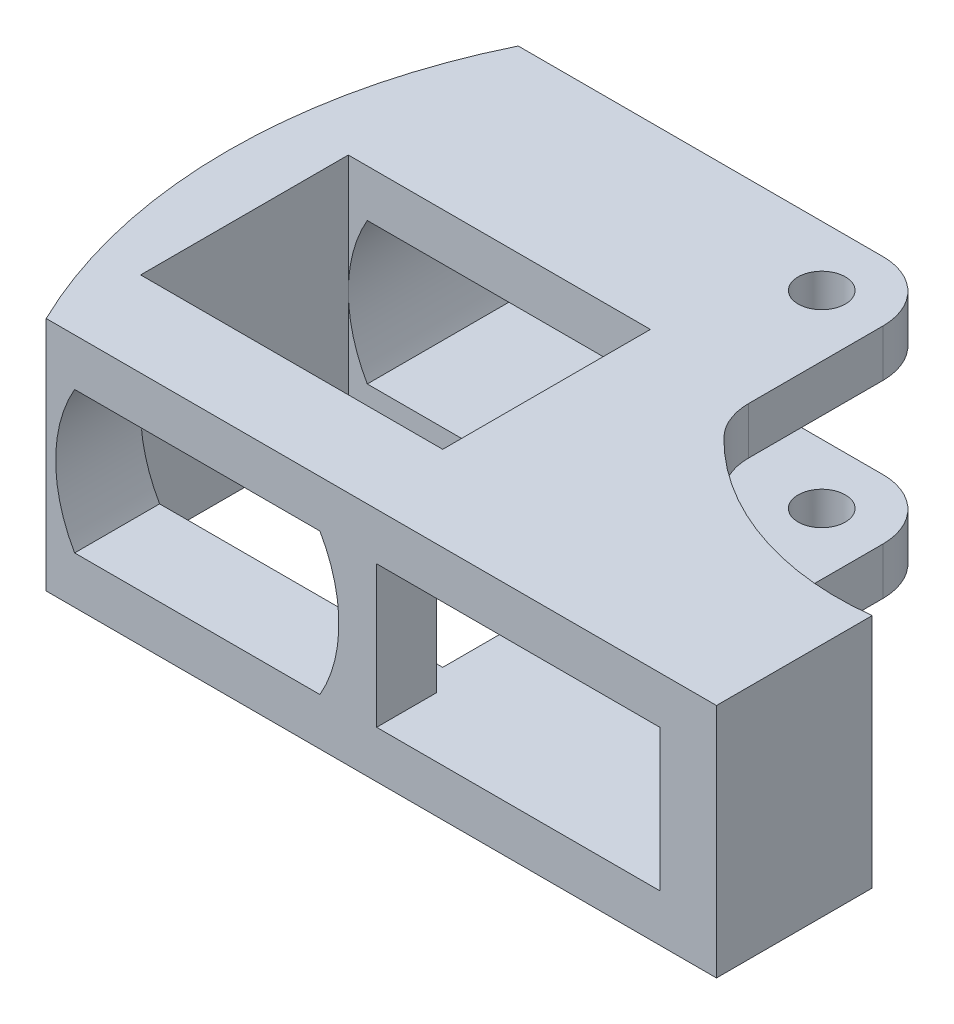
from build123d import *

# Parameters (mm, degrees)
BOSS_EXTRUDE1_DEPTH = 12.5
FILLET1_R           = 6.35
SKETCH2_W           = 32
SKETCH2_H           = 22
CUT_EXTRUDE1_DEPTH  = 70.48831649
SKETCH3_W           = 30
SKETCH3_H           = 15
CUT_EXTRUDE2_DEPTH  = 67.029358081
CUT_EXTRUDE4_START  = -43.65
SKETCH7_W           = 18
SKETCH7_H           = 15
CUT_EXTRUDE4_DEPTH  = 43.65
SKETCH8_R           = 2.5
CUT_EXTRUDE5_DEPTH  = 70.48831649


with BuildPart() as part:
    # Sketch1 → Boss-Extrude1 (new, symmetric)
    with BuildSketch(Plane(origin=(0, 0, 0), x_dir=(1, 0, 0), z_dir=(0, 1, 0))):
        with BuildLine():
            Line((-35.5, 0), (35.5, 0))
            Line((35.5, 0), (35.5, 16.5))
            ThreePointArc((35.5, 16.5), (21.146605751, 18.39873805), (9.5, 27))
            Line((9.5, 27), (9.5, 50))
            Line((9.5, 50), (-35.5, 50))
            ThreePointArc((-35.5, 50), (-41.275006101, 25), (-35.5, 0))
        make_face()
    extrude(amount=BOSS_EXTRUDE1_DEPTH, both=True)

    # Fillet1
    fillet1_edges = [part.edges().sort_by_distance(p)[0] for p in [
        (9.5, 0, -50),
        (9.5, 0, -27),
    ]]
    fillet(fillet1_edges, radius=FILLET1_R)

    # Sketch2 → Cut-Extrude1 (cut, through all)
    with BuildSketch(Plane(origin=(0, 12.5, 0), x_dir=(1, 0, 0), z_dir=(0, 1, 0))):
        with Locations((-18.5, 20)):
            Rectangle(SKETCH2_W, SKETCH2_H)
    extrude(amount=-CUT_EXTRUDE1_DEPTH, mode=Mode.SUBTRACT)

    # Sketch3 → Cut-Extrude2 (cut, through all)
    with BuildSketch(Plane.XY):
        with BuildLine():
            Line((-32.490381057, 7.5), (-6.509618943, 7.5))
            ThreePointArc((-6.509618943, 7.5), (-4.5, 0), (-6.509618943, -7.5))
            Line((-6.509618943, -7.5), (-32.490381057, -7.5))
            ThreePointArc((-32.490381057, -7.5), (-34.5, 0), (-32.490381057, 7.5))
        make_face()
        with Locations((14.5, 0)):
            Rectangle(SKETCH3_W, SKETCH3_H)
    extrude(amount=-CUT_EXTRUDE2_DEPTH, mode=Mode.SUBTRACT)

    # Sketch7 → Cut-Extrude4 (cut)
    with BuildSketch(Plane(origin=(0, 0, -50), x_dir=(-1, 0, 0), z_dir=(0, 0, -1)).offset(CUT_EXTRUDE4_START)):
        Rectangle(SKETCH7_W, SKETCH7_H)
    extrude(amount=CUT_EXTRUDE4_DEPTH, mode=Mode.SUBTRACT)

    # Sketch8 → Cut-Extrude5 (cut, through all)
    with BuildSketch(Plane(origin=(0, 12.5, 0), x_dir=(1, 0, 0), z_dir=(0, 1, 0))):
        with Locations(Location((3, 43.65, 0), (0, 0, 270))):
            Circle(SKETCH8_R)
    extrude(amount=-CUT_EXTRUDE5_DEPTH, mode=Mode.SUBTRACT)


solid = part.part
